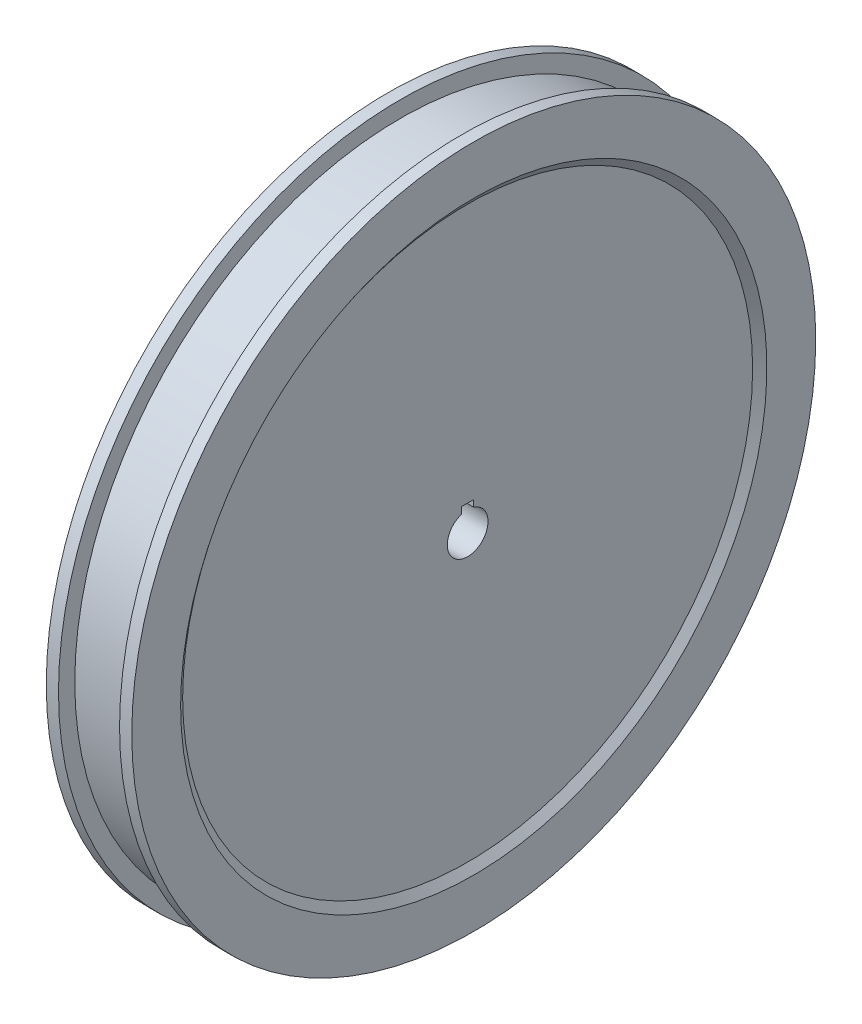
ISO-10303-21;
HEADER;
FILE_DESCRIPTION(('STEP AP214'),'2;1');
FILE_NAME('part.step','',(''),(''),'','','');
FILE_SCHEMA(('AUTOMOTIVE_DESIGN { 1 0 10303 214 1 1 1 1 }'));
ENDSEC;
DATA;
#1=APPLICATION_CONTEXT('core data for automotive mechanical design processes');
#2=APPLICATION_PROTOCOL_DEFINITION('international standard','automotive_design',2000,#1);
#3=PRODUCT_CONTEXT('',#1,'mechanical');
#4=PRODUCT('Part','Part','',(#3));
#5=PRODUCT_RELATED_PRODUCT_CATEGORY('part','',(#4));
#6=PRODUCT_DEFINITION_FORMATION('','',#4);
#7=PRODUCT_DEFINITION_CONTEXT('part definition',#1,'design');
#8=PRODUCT_DEFINITION('design','',#6,#7);
#9=PRODUCT_DEFINITION_SHAPE('','',#8);
#10=(LENGTH_UNIT() NAMED_UNIT(*) SI_UNIT(.MILLI.,.METRE.));
#11=(NAMED_UNIT(*) PLANE_ANGLE_UNIT() SI_UNIT($,.RADIAN.));
#12=(NAMED_UNIT(*) SI_UNIT($,.STERADIAN.) SOLID_ANGLE_UNIT());
#13=UNCERTAINTY_MEASURE_WITH_UNIT(LENGTH_MEASURE(1.E-05),#10,'distance_accuracy_value','');
#14=(GEOMETRIC_REPRESENTATION_CONTEXT(3) GLOBAL_UNCERTAINTY_ASSIGNED_CONTEXT((#13)) GLOBAL_UNIT_ASSIGNED_CONTEXT((#10,
#11,#12)) REPRESENTATION_CONTEXT('',''));
#15=CARTESIAN_POINT('',(0.,0.,0.));
#16=DIRECTION('',(0.,0.,1.));
#17=DIRECTION('',(1.,0.,0.));
#18=AXIS2_PLACEMENT_3D('',#15,#16,#17);
#19=CARTESIAN_POINT('',(0.,0.,0.));
#20=DIRECTION('',(-1.,0.,0.));
#21=DIRECTION('',(0.,0.,1.));
#22=AXIS2_PLACEMENT_3D('',#19,#20,#21);
#23=CYLINDRICAL_SURFACE('',#22,5.);
#24=CARTESIAN_POINT('',(9.,0.,0.));
#25=DIRECTION('',(-1.,0.,0.));
#26=DIRECTION('',(0.,0.,1.));
#27=AXIS2_PLACEMENT_3D('',#24,#25,#26);
#28=CIRCLE('',#27,5.);
#29=CARTESIAN_POINT('',(9.,4.76969600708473,-1.5));
#30=VERTEX_POINT('',#29);
#31=CARTESIAN_POINT('',(9.,4.76969600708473,1.5));
#32=VERTEX_POINT('',#31);
#33=EDGE_CURVE('E39',#30,#32,#28,.T.);
#34=ORIENTED_EDGE('',*,*,#33,.F.);
#35=DIRECTION('',(-1.,0.,0.));
#36=VECTOR('',#35,1.);
#37=CARTESIAN_POINT('',(0.,4.76969600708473,-1.5));
#38=LINE('',#37,#36);
#39=CARTESIAN_POINT('',(-9.00000000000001,4.76969600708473,-1.5));
#40=VERTEX_POINT('',#39);
#41=EDGE_CURVE('E53',#30,#40,#38,.T.);
#42=ORIENTED_EDGE('',*,*,#41,.T.);
#43=CARTESIAN_POINT('',(-9.,0.,0.));
#44=DIRECTION('',(-1.,0.,0.));
#45=DIRECTION('',(0.,0.,1.));
#46=AXIS2_PLACEMENT_3D('',#43,#44,#45);
#47=CIRCLE('',#46,5.);
#48=CARTESIAN_POINT('',(-9.,4.76969600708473,1.5));
#49=VERTEX_POINT('',#48);
#50=EDGE_CURVE('E101',#40,#49,#47,.T.);
#51=ORIENTED_EDGE('',*,*,#50,.T.);
#52=DIRECTION('',(-1.,0.,0.));
#53=VECTOR('',#52,1.);
#54=CARTESIAN_POINT('',(0.,4.76969600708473,1.5));
#55=LINE('',#54,#53);
#56=EDGE_CURVE('E46',#49,#32,#55,.F.);
#57=ORIENTED_EDGE('',*,*,#56,.T.);
#58=EDGE_LOOP('',(#34,#42,#51,#57));
#59=FACE_BOUND('',#58,.T.);
#60=ADVANCED_FACE('F32',(#59),#23,.F.);
#61=CARTESIAN_POINT('',(9.00000000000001,70.,0.));
#62=DIRECTION('',(-1.,0.,0.));
#63=DIRECTION('',(0.,0.,1.));
#64=AXIS2_PLACEMENT_3D('',#61,#62,#63);
#65=PLANE('',#64);
#66=CARTESIAN_POINT('',(9.00000000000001,0.,0.));
#67=DIRECTION('',(-1.,0.,0.));
#68=DIRECTION('',(0.,0.,1.));
#69=AXIS2_PLACEMENT_3D('',#66,#67,#68);
#70=CIRCLE('',#69,70.);
#71=CARTESIAN_POINT('',(9.00000000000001,0.,70.));
#72=VERTEX_POINT('',#71);
#73=EDGE_CURVE('E130',#72,#72,#70,.T.);
#74=ORIENTED_EDGE('',*,*,#73,.F.);
#75=EDGE_LOOP('',(#74));
#76=FACE_BOUND('',#75,.T.);
#77=DIRECTION('',(0.,0.,-1.));
#78=VECTOR('',#77,1.);
#79=CARTESIAN_POINT('',(9.00000000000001,6.4,0.));
#80=LINE('',#79,#78);
#81=CARTESIAN_POINT('',(9.00000000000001,6.4,1.5));
#82=VERTEX_POINT('',#81);
#83=CARTESIAN_POINT('',(9.00000000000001,6.4,-1.5));
#84=VERTEX_POINT('',#83);
#85=EDGE_CURVE('E79',#82,#84,#80,.T.);
#86=ORIENTED_EDGE('',*,*,#85,.T.);
#87=DIRECTION('',(0.,-1.,0.));
#88=VECTOR('',#87,1.);
#89=CARTESIAN_POINT('',(9.00000000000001,70.,-1.5));
#90=LINE('',#89,#88);
#91=EDGE_CURVE('E98',#84,#30,#90,.T.);
#92=ORIENTED_EDGE('',*,*,#91,.T.);
#93=ORIENTED_EDGE('',*,*,#33,.T.);
#94=DIRECTION('',(0.,1.,0.));
#95=VECTOR('',#94,1.);
#96=CARTESIAN_POINT('',(9.00000000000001,70.,1.5));
#97=LINE('',#96,#95);
#98=EDGE_CURVE('E93',#32,#82,#97,.T.);
#99=ORIENTED_EDGE('',*,*,#98,.T.);
#100=EDGE_LOOP('',(#86,#92,#93,#99));
#101=FACE_BOUND('',#100,.T.);
#102=ADVANCED_FACE('F135',(#76,#101),#65,.F.);
#103=CARTESIAN_POINT('',(9.00000000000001,0.,0.));
#104=DIRECTION('',(1.,0.,0.));
#105=DIRECTION('',(0.,0.,-1.));
#106=AXIS2_PLACEMENT_3D('',#103,#104,#105);
#107=CONICAL_SURFACE('',#106,70.,0.927295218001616);
#108=CARTESIAN_POINT('',(10.5,0.,0.));
#109=DIRECTION('',(-1.,0.,0.));
#110=DIRECTION('',(0.,0.,1.));
#111=AXIS2_PLACEMENT_3D('',#108,#109,#110);
#112=CIRCLE('',#111,72.);
#113=CARTESIAN_POINT('',(10.5,0.,72.));
#114=VERTEX_POINT('',#113);
#115=EDGE_CURVE('E127',#114,#114,#112,.T.);
#116=ORIENTED_EDGE('',*,*,#115,.F.);
#117=EDGE_LOOP('',(#116));
#118=FACE_BOUND('',#117,.T.);
#119=ORIENTED_EDGE('',*,*,#73,.T.);
#120=EDGE_LOOP('',(#119));
#121=FACE_BOUND('',#120,.T.);
#122=ADVANCED_FACE('F141',(#118,#121),#107,.F.);
#123=CARTESIAN_POINT('',(10.5,84.,0.));
#124=DIRECTION('',(-1.,0.,0.));
#125=DIRECTION('',(0.,0.,1.));
#126=AXIS2_PLACEMENT_3D('',#123,#124,#125);
#127=PLANE('',#126);
#128=CARTESIAN_POINT('',(10.5,0.,0.));
#129=DIRECTION('',(-1.,0.,0.));
#130=DIRECTION('',(0.,0.,1.));
#131=AXIS2_PLACEMENT_3D('',#128,#129,#130);
#132=CIRCLE('',#131,84.);
#133=CARTESIAN_POINT('',(10.5,0.,84.));
#134=VERTEX_POINT('',#133);
#135=EDGE_CURVE('E124',#134,#134,#132,.T.);
#136=ORIENTED_EDGE('',*,*,#135,.F.);
#137=EDGE_LOOP('',(#136));
#138=FACE_BOUND('',#137,.T.);
#139=ORIENTED_EDGE('',*,*,#115,.T.);
#140=EDGE_LOOP('',(#139));
#141=FACE_BOUND('',#140,.T.);
#142=ADVANCED_FACE('F146',(#138,#141),#127,.F.);
#143=CARTESIAN_POINT('',(0.,0.,0.));
#144=DIRECTION('',(-1.,0.,0.));
#145=DIRECTION('',(0.,0.,1.));
#146=AXIS2_PLACEMENT_3D('',#143,#144,#145);
#147=CYLINDRICAL_SURFACE('',#146,84.);
#148=CARTESIAN_POINT('',(7.5,0.,0.));
#149=DIRECTION('',(-1.,0.,0.));
#150=DIRECTION('',(0.,0.,1.));
#151=AXIS2_PLACEMENT_3D('',#148,#149,#150);
#152=CIRCLE('',#151,84.);
#153=CARTESIAN_POINT('',(7.5,0.,84.));
#154=VERTEX_POINT('',#153);
#155=EDGE_CURVE('E121',#154,#154,#152,.T.);
#156=ORIENTED_EDGE('',*,*,#155,.F.);
#157=EDGE_LOOP('',(#156));
#158=FACE_BOUND('',#157,.T.);
#159=ORIENTED_EDGE('',*,*,#135,.T.);
#160=EDGE_LOOP('',(#159));
#161=FACE_BOUND('',#160,.T.);
#162=ADVANCED_FACE('F153',(#158,#161),#147,.T.);
#163=CARTESIAN_POINT('',(7.5,80.,0.));
#164=DIRECTION('',(1.,0.,0.));
#165=DIRECTION('',(0.,0.,-1.));
#166=AXIS2_PLACEMENT_3D('',#163,#164,#165);
#167=PLANE('',#166);
#168=CARTESIAN_POINT('',(7.5,0.,0.));
#169=DIRECTION('',(-1.,0.,0.));
#170=DIRECTION('',(0.,0.,1.));
#171=AXIS2_PLACEMENT_3D('',#168,#169,#170);
#172=CIRCLE('',#171,80.);
#173=CARTESIAN_POINT('',(7.5,0.,80.));
#174=VERTEX_POINT('',#173);
#175=EDGE_CURVE('E118',#174,#174,#172,.T.);
#176=ORIENTED_EDGE('',*,*,#175,.F.);
#177=EDGE_LOOP('',(#176));
#178=FACE_BOUND('',#177,.T.);
#179=ORIENTED_EDGE('',*,*,#155,.T.);
#180=EDGE_LOOP('',(#179));
#181=FACE_BOUND('',#180,.T.);
#182=ADVANCED_FACE('F157',(#178,#181),#167,.F.);
#183=CARTESIAN_POINT('',(0.,0.,0.));
#184=DIRECTION('',(-1.,0.,0.));
#185=DIRECTION('',(0.,0.,1.));
#186=AXIS2_PLACEMENT_3D('',#183,#184,#185);
#187=CYLINDRICAL_SURFACE('',#186,80.);
#188=CARTESIAN_POINT('',(-7.5,0.,0.));
#189=DIRECTION('',(-1.,0.,0.));
#190=DIRECTION('',(0.,0.,1.));
#191=AXIS2_PLACEMENT_3D('',#188,#189,#190);
#192=CIRCLE('',#191,80.);
#193=CARTESIAN_POINT('',(-7.5,0.,80.));
#194=VERTEX_POINT('',#193);
#195=EDGE_CURVE('E115',#194,#194,#192,.T.);
#196=ORIENTED_EDGE('',*,*,#195,.F.);
#197=EDGE_LOOP('',(#196));
#198=FACE_BOUND('',#197,.T.);
#199=ORIENTED_EDGE('',*,*,#175,.T.);
#200=EDGE_LOOP('',(#199));
#201=FACE_BOUND('',#200,.T.);
#202=ADVANCED_FACE('F161',(#198,#201),#187,.T.);
#203=CARTESIAN_POINT('',(-7.5,80.,0.));
#204=DIRECTION('',(-1.,0.,0.));
#205=DIRECTION('',(0.,0.,1.));
#206=AXIS2_PLACEMENT_3D('',#203,#204,#205);
#207=PLANE('',#206);
#208=CARTESIAN_POINT('',(-7.5,0.,0.));
#209=DIRECTION('',(-1.,0.,0.));
#210=DIRECTION('',(0.,0.,1.));
#211=AXIS2_PLACEMENT_3D('',#208,#209,#210);
#212=CIRCLE('',#211,84.);
#213=CARTESIAN_POINT('',(-7.5,0.,84.));
#214=VERTEX_POINT('',#213);
#215=EDGE_CURVE('E112',#214,#214,#212,.T.);
#216=ORIENTED_EDGE('',*,*,#215,.F.);
#217=EDGE_LOOP('',(#216));
#218=FACE_BOUND('',#217,.T.);
#219=ORIENTED_EDGE('',*,*,#195,.T.);
#220=EDGE_LOOP('',(#219));
#221=FACE_BOUND('',#220,.T.);
#222=ADVANCED_FACE('F165',(#218,#221),#207,.F.);
#223=CARTESIAN_POINT('',(0.,0.,0.));
#224=DIRECTION('',(-1.,0.,0.));
#225=DIRECTION('',(0.,0.,1.));
#226=AXIS2_PLACEMENT_3D('',#223,#224,#225);
#227=CYLINDRICAL_SURFACE('',#226,84.);
#228=CARTESIAN_POINT('',(-10.5,0.,0.));
#229=DIRECTION('',(-1.,0.,0.));
#230=DIRECTION('',(0.,0.,1.));
#231=AXIS2_PLACEMENT_3D('',#228,#229,#230);
#232=CIRCLE('',#231,84.);
#233=CARTESIAN_POINT('',(-10.5,0.,84.));
#234=VERTEX_POINT('',#233);
#235=EDGE_CURVE('E109',#234,#234,#232,.T.);
#236=ORIENTED_EDGE('',*,*,#235,.F.);
#237=EDGE_LOOP('',(#236));
#238=FACE_BOUND('',#237,.T.);
#239=ORIENTED_EDGE('',*,*,#215,.T.);
#240=EDGE_LOOP('',(#239));
#241=FACE_BOUND('',#240,.T.);
#242=ADVANCED_FACE('F169',(#238,#241),#227,.T.);
#243=CARTESIAN_POINT('',(-10.5,84.,0.));
#244=DIRECTION('',(1.,0.,0.));
#245=DIRECTION('',(0.,0.,-1.));
#246=AXIS2_PLACEMENT_3D('',#243,#244,#245);
#247=PLANE('',#246);
#248=CARTESIAN_POINT('',(-10.5,0.,0.));
#249=DIRECTION('',(-1.,0.,0.));
#250=DIRECTION('',(0.,0.,1.));
#251=AXIS2_PLACEMENT_3D('',#248,#249,#250);
#252=CIRCLE('',#251,72.);
#253=CARTESIAN_POINT('',(-10.5,0.,72.));
#254=VERTEX_POINT('',#253);
#255=EDGE_CURVE('E106',#254,#254,#252,.T.);
#256=ORIENTED_EDGE('',*,*,#255,.F.);
#257=EDGE_LOOP('',(#256));
#258=FACE_BOUND('',#257,.T.);
#259=ORIENTED_EDGE('',*,*,#235,.T.);
#260=EDGE_LOOP('',(#259));
#261=FACE_BOUND('',#260,.T.);
#262=ADVANCED_FACE('F173',(#258,#261),#247,.F.);
#263=CARTESIAN_POINT('',(-10.5,0.,0.));
#264=DIRECTION('',(-1.,0.,0.));
#265=DIRECTION('',(0.,0.,1.));
#266=AXIS2_PLACEMENT_3D('',#263,#264,#265);
#267=CONICAL_SURFACE('',#266,72.,0.927295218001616);
#268=CARTESIAN_POINT('',(-9.00000000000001,0.,0.));
#269=DIRECTION('',(-1.,0.,0.));
#270=DIRECTION('',(0.,0.,1.));
#271=AXIS2_PLACEMENT_3D('',#268,#269,#270);
#272=CIRCLE('',#271,70.);
#273=CARTESIAN_POINT('',(-9.00000000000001,0.,70.));
#274=VERTEX_POINT('',#273);
#275=EDGE_CURVE('E103',#274,#274,#272,.T.);
#276=ORIENTED_EDGE('',*,*,#275,.F.);
#277=EDGE_LOOP('',(#276));
#278=FACE_BOUND('',#277,.T.);
#279=ORIENTED_EDGE('',*,*,#255,.T.);
#280=EDGE_LOOP('',(#279));
#281=FACE_BOUND('',#280,.T.);
#282=ADVANCED_FACE('F177',(#278,#281),#267,.F.);
#283=CARTESIAN_POINT('',(-9.00000000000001,70.,0.));
#284=DIRECTION('',(1.,0.,0.));
#285=DIRECTION('',(0.,0.,-1.));
#286=AXIS2_PLACEMENT_3D('',#283,#284,#285);
#287=PLANE('',#286);
#288=ORIENTED_EDGE('',*,*,#50,.F.);
#289=DIRECTION('',(0.,-1.,0.));
#290=VECTOR('',#289,1.);
#291=CARTESIAN_POINT('',(-9.00000000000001,6.4,-1.5));
#292=LINE('',#291,#290);
#293=CARTESIAN_POINT('',(-9.00000000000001,6.4,-1.5));
#294=VERTEX_POINT('',#293);
#295=EDGE_CURVE('E89',#294,#40,#292,.T.);
#296=ORIENTED_EDGE('',*,*,#295,.F.);
#297=DIRECTION('',(0.,0.,-1.));
#298=VECTOR('',#297,1.);
#299=CARTESIAN_POINT('',(-9.00000000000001,6.4,-1.5));
#300=LINE('',#299,#298);
#301=CARTESIAN_POINT('',(-9.00000000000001,6.4,1.5));
#302=VERTEX_POINT('',#301);
#303=EDGE_CURVE('E76',#302,#294,#300,.T.);
#304=ORIENTED_EDGE('',*,*,#303,.F.);
#305=DIRECTION('',(0.,-1.,0.));
#306=VECTOR('',#305,1.);
#307=CARTESIAN_POINT('',(-9.00000000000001,70.,1.5));
#308=LINE('',#307,#306);
#309=EDGE_CURVE('E11',#302,#49,#308,.T.);
#310=ORIENTED_EDGE('',*,*,#309,.T.);
#311=EDGE_LOOP('',(#288,#296,#304,#310));
#312=FACE_BOUND('',#311,.T.);
#313=ORIENTED_EDGE('',*,*,#275,.T.);
#314=EDGE_LOOP('',(#313));
#315=FACE_BOUND('',#314,.T.);
#316=ADVANCED_FACE('F87',(#312,#315),#287,.F.);
#317=CARTESIAN_POINT('',(10.5,6.4,-1.5));
#318=DIRECTION('',(0.,0.,-1.));
#319=DIRECTION('',(-1.,0.,0.));
#320=AXIS2_PLACEMENT_3D('',#317,#318,#319);
#321=PLANE('',#320);
#322=ORIENTED_EDGE('',*,*,#91,.F.);
#323=DIRECTION('',(-1.,0.,0.));
#324=VECTOR('',#323,1.);
#325=CARTESIAN_POINT('',(10.5,6.4,-1.5));
#326=LINE('',#325,#324);
#327=EDGE_CURVE('E81',#84,#294,#326,.T.);
#328=ORIENTED_EDGE('',*,*,#327,.T.);
#329=ORIENTED_EDGE('',*,*,#295,.T.);
#330=ORIENTED_EDGE('',*,*,#41,.F.);
#331=EDGE_LOOP('',(#322,#328,#329,#330));
#332=FACE_BOUND('',#331,.T.);
#333=ADVANCED_FACE('F184',(#332),#321,.F.);
#334=CARTESIAN_POINT('',(10.5,6.4,-1.5));
#335=DIRECTION('',(0.,1.,0.));
#336=DIRECTION('',(0.,0.,1.));
#337=AXIS2_PLACEMENT_3D('',#334,#335,#336);
#338=PLANE('',#337);
#339=DIRECTION('',(-1.,0.,0.));
#340=VECTOR('',#339,1.);
#341=CARTESIAN_POINT('',(10.5,6.4,1.5));
#342=LINE('',#341,#340);
#343=EDGE_CURVE('E72',#82,#302,#342,.T.);
#344=ORIENTED_EDGE('',*,*,#343,.T.);
#345=ORIENTED_EDGE('',*,*,#303,.T.);
#346=ORIENTED_EDGE('',*,*,#327,.F.);
#347=ORIENTED_EDGE('',*,*,#85,.F.);
#348=EDGE_LOOP('',(#344,#345,#346,#347));
#349=FACE_BOUND('',#348,.T.);
#350=ADVANCED_FACE('F73',(#349),#338,.F.);
#351=CARTESIAN_POINT('',(10.5,6.4,1.5));
#352=DIRECTION('',(0.,0.,1.));
#353=DIRECTION('',(0.,-1.,0.));
#354=AXIS2_PLACEMENT_3D('',#351,#352,#353);
#355=PLANE('',#354);
#356=ORIENTED_EDGE('',*,*,#309,.F.);
#357=ORIENTED_EDGE('',*,*,#343,.F.);
#358=ORIENTED_EDGE('',*,*,#98,.F.);
#359=ORIENTED_EDGE('',*,*,#56,.F.);
#360=EDGE_LOOP('',(#356,#357,#358,#359));
#361=FACE_BOUND('',#360,.T.);
#362=ADVANCED_FACE('F83',(#361),#355,.F.);
#363=CLOSED_SHELL('',(#60,#102,#122,#142,#162,#182,#202,#222,#242,#262,#282,#316,#333,#350,#362));
#364=MANIFOLD_SOLID_BREP('B2',#363);
#365=ADVANCED_BREP_SHAPE_REPRESENTATION('',(#18,#364),#14);
#366=SHAPE_DEFINITION_REPRESENTATION(#9,#365);
ENDSEC;
END-ISO-10303-21;
